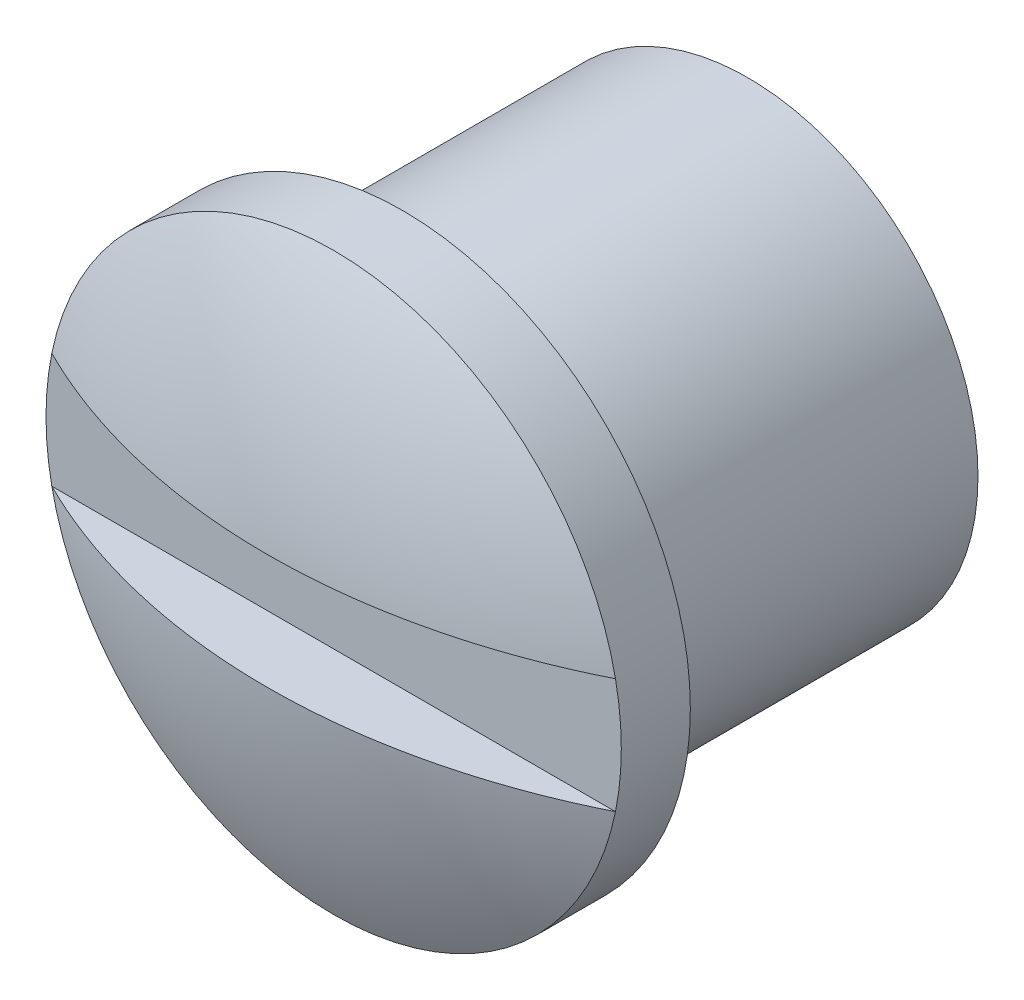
from build123d import *

# Parameters (mm, degrees)
SKETCH_1_R          = 10
EXTRUDE_1_DEPTH     = 15
SKETCH_2_R          = 12.5
EXTRUDE_2_DEPTH     = 3
SKETCH_4_W          = 75
SKETCH_4_H          = 5
CUT_EXTRUDE_1_DEPTH = 3


with BuildPart() as part:
    # Sketch 1 → Extrude 1 (new body)
    with BuildSketch(Plane.XY):
        Circle(SKETCH_1_R)
    extrude(amount=EXTRUDE_1_DEPTH)

    # Sketch 2 → Extrude 2 (add)
    with BuildSketch(Plane.XY.offset(15)):
        Circle(SKETCH_2_R)
    extrude(amount=EXTRUDE_2_DEPTH)

    # Sketch 3 → Revolve 1 (revolve)
    with BuildSketch(Plane(origin=(0, 0, 0), x_dir=(1, 0, 0), z_dir=(0, 1, 0))):
        with BuildLine():
            Line((0, -18), (0, -21))
            ThreePointArc((0, -21), (6.427480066, -20.239500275), (12.5, -18))
            Line((12.5, -18), (0, -18))
        make_face()
    revolve(axis=Axis((0, 0, 18), (0, 0, 1)))

    # Sketch 4 → Cut-Extrude 1 (cut)
    with BuildSketch(Plane(origin=(0, 0, 21), x_dir=(-1, 0, 0), z_dir=(0, 0, -1))):
        Rectangle(SKETCH_4_W, SKETCH_4_H)
    extrude(amount=CUT_EXTRUDE_1_DEPTH, mode=Mode.SUBTRACT)


solid = part.part
